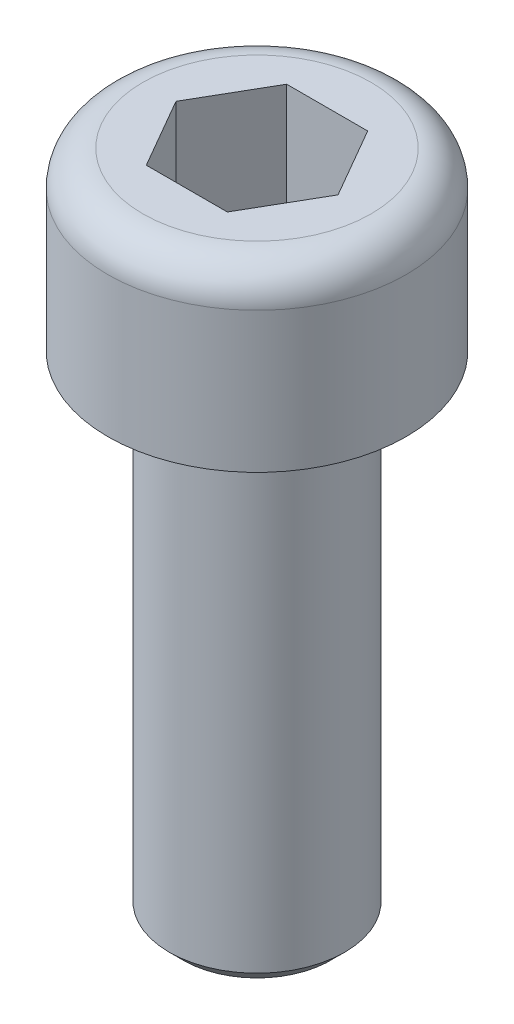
ISO-10303-21;
HEADER;
FILE_DESCRIPTION(('STEP AP214'),'2;1');
FILE_NAME('part.step','',(''),(''),'','','');
FILE_SCHEMA(('AUTOMOTIVE_DESIGN { 1 0 10303 214 1 1 1 1 }'));
ENDSEC;
DATA;
#1=APPLICATION_CONTEXT('core data for automotive mechanical design processes');
#2=APPLICATION_PROTOCOL_DEFINITION('international standard','automotive_design',2000,#1);
#3=PRODUCT_CONTEXT('',#1,'mechanical');
#4=PRODUCT('Part','Part','',(#3));
#5=PRODUCT_RELATED_PRODUCT_CATEGORY('part','',(#4));
#6=PRODUCT_DEFINITION_FORMATION('','',#4);
#7=PRODUCT_DEFINITION_CONTEXT('part definition',#1,'design');
#8=PRODUCT_DEFINITION('design','',#6,#7);
#9=PRODUCT_DEFINITION_SHAPE('','',#8);
#10=(LENGTH_UNIT() NAMED_UNIT(*) SI_UNIT(.MILLI.,.METRE.));
#11=(NAMED_UNIT(*) PLANE_ANGLE_UNIT() SI_UNIT($,.RADIAN.));
#12=(NAMED_UNIT(*) SI_UNIT($,.STERADIAN.) SOLID_ANGLE_UNIT());
#13=UNCERTAINTY_MEASURE_WITH_UNIT(LENGTH_MEASURE(1.E-05),#10,'distance_accuracy_value','');
#14=(GEOMETRIC_REPRESENTATION_CONTEXT(3) GLOBAL_UNCERTAINTY_ASSIGNED_CONTEXT((#13)) GLOBAL_UNIT_ASSIGNED_CONTEXT((#10,
#11,#12)) REPRESENTATION_CONTEXT('',''));
#15=CARTESIAN_POINT('',(0.,0.,0.));
#16=DIRECTION('',(0.,0.,1.));
#17=DIRECTION('',(1.,0.,0.));
#18=AXIS2_PLACEMENT_3D('',#15,#16,#17);
#19=CARTESIAN_POINT('',(0.,5.,0.));
#20=DIRECTION('',(0.,-1.,0.));
#21=DIRECTION('',(1.,0.,0.));
#22=AXIS2_PLACEMENT_3D('',#19,#20,#21);
#23=PLANE('',#22);
#24=DIRECTION('',(-0.5,0.,-0.866025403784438));
#25=VECTOR('',#24,1.);
#26=CARTESIAN_POINT('',(2.3094010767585,5.,0.));
#27=LINE('',#26,#25);
#28=CARTESIAN_POINT('',(2.3094010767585,5.,0.));
#29=VERTEX_POINT('',#28);
#30=CARTESIAN_POINT('',(1.15470053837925,5.,-2.));
#31=VERTEX_POINT('',#30);
#32=EDGE_CURVE('E124',#29,#31,#27,.T.);
#33=ORIENTED_EDGE('',*,*,#32,.F.);
#34=DIRECTION('',(0.5,0.,-0.866025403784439));
#35=VECTOR('',#34,1.);
#36=CARTESIAN_POINT('',(1.15470053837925,5.,2.));
#37=LINE('',#36,#35);
#38=CARTESIAN_POINT('',(1.15470053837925,5.,2.));
#39=VERTEX_POINT('',#38);
#40=EDGE_CURVE('E50',#39,#29,#37,.T.);
#41=ORIENTED_EDGE('',*,*,#40,.F.);
#42=DIRECTION('',(1.,0.,0.));
#43=VECTOR('',#42,1.);
#44=CARTESIAN_POINT('',(-1.15470053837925,5.,2.));
#45=LINE('',#44,#43);
#46=CARTESIAN_POINT('',(-1.15470053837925,5.,2.));
#47=VERTEX_POINT('',#46);
#48=EDGE_CURVE('E133',#47,#39,#45,.T.);
#49=ORIENTED_EDGE('',*,*,#48,.F.);
#50=DIRECTION('',(0.5,0.,0.866025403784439));
#51=VECTOR('',#50,1.);
#52=CARTESIAN_POINT('',(-2.3094010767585,5.,0.));
#53=LINE('',#52,#51);
#54=CARTESIAN_POINT('',(-2.3094010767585,5.,0.));
#55=VERTEX_POINT('',#54);
#56=EDGE_CURVE('E131',#55,#47,#53,.T.);
#57=ORIENTED_EDGE('',*,*,#56,.F.);
#58=DIRECTION('',(-0.5,0.,0.866025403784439));
#59=VECTOR('',#58,1.);
#60=CARTESIAN_POINT('',(-1.15470053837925,5.,-2.));
#61=LINE('',#60,#59);
#62=CARTESIAN_POINT('',(-1.15470053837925,5.,-2.));
#63=VERTEX_POINT('',#62);
#64=EDGE_CURVE('E98',#63,#55,#61,.T.);
#65=ORIENTED_EDGE('',*,*,#64,.F.);
#66=DIRECTION('',(-1.,0.,0.));
#67=VECTOR('',#66,1.);
#68=CARTESIAN_POINT('',(1.15470053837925,5.,-2.));
#69=LINE('',#68,#67);
#70=EDGE_CURVE('E127',#31,#63,#69,.T.);
#71=ORIENTED_EDGE('',*,*,#70,.F.);
#72=EDGE_LOOP('',(#33,#41,#49,#57,#65,#71));
#73=FACE_BOUND('',#72,.T.);
#74=CARTESIAN_POINT('',(0.,5.,0.));
#75=DIRECTION('',(0.,1.,0.));
#76=DIRECTION('',(-1.,0.,0.));
#77=AXIS2_PLACEMENT_3D('',#74,#75,#76);
#78=CIRCLE('',#77,3.25);
#79=CARTESIAN_POINT('',(-3.24999999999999,5.,0.));
#80=VERTEX_POINT('',#79);
#81=EDGE_CURVE('E11',#80,#80,#78,.T.);
#82=ORIENTED_EDGE('',*,*,#81,.T.);
#83=EDGE_LOOP('',(#82));
#84=FACE_BOUND('',#83,.T.);
#85=ADVANCED_FACE('F36',(#73,#84),#23,.F.);
#86=CARTESIAN_POINT('',(0.,4.,0.));
#87=DIRECTION('',(0.,1.,0.));
#88=DIRECTION('',(-1.,0.,0.));
#89=AXIS2_PLACEMENT_3D('',#86,#87,#88);
#90=TOROIDAL_SURFACE('',#89,3.25,1.);
#91=ORIENTED_EDGE('',*,*,#81,.F.);
#92=EDGE_LOOP('',(#91));
#93=FACE_BOUND('',#92,.T.);
#94=CARTESIAN_POINT('',(0.,4.,0.));
#95=DIRECTION('',(0.,1.,0.));
#96=DIRECTION('',(-1.,0.,0.));
#97=AXIS2_PLACEMENT_3D('',#94,#95,#96);
#98=CIRCLE('',#97,4.24999999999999);
#99=CARTESIAN_POINT('',(-4.24999999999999,4.,0.));
#100=VERTEX_POINT('',#99);
#101=EDGE_CURVE('E43',#100,#100,#98,.T.);
#102=ORIENTED_EDGE('',*,*,#101,.T.);
#103=EDGE_LOOP('',(#102));
#104=FACE_BOUND('',#103,.T.);
#105=ADVANCED_FACE('F159',(#93,#104),#90,.T.);
#106=CARTESIAN_POINT('',(0.,5.,0.));
#107=DIRECTION('',(0.,1.,0.));
#108=DIRECTION('',(-1.,0.,0.));
#109=AXIS2_PLACEMENT_3D('',#106,#107,#108);
#110=CYLINDRICAL_SURFACE('',#109,4.24999999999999);
#111=ORIENTED_EDGE('',*,*,#101,.F.);
#112=EDGE_LOOP('',(#111));
#113=FACE_BOUND('',#112,.T.);
#114=CARTESIAN_POINT('',(0.,0.,0.));
#115=DIRECTION('',(0.,1.,0.));
#116=DIRECTION('',(-1.,0.,0.));
#117=AXIS2_PLACEMENT_3D('',#114,#115,#116);
#118=CIRCLE('',#117,4.25);
#119=CARTESIAN_POINT('',(-4.24999999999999,0.,0.));
#120=VERTEX_POINT('',#119);
#121=EDGE_CURVE('E154',#120,#120,#118,.T.);
#122=ORIENTED_EDGE('',*,*,#121,.T.);
#123=EDGE_LOOP('',(#122));
#124=FACE_BOUND('',#123,.T.);
#125=ADVANCED_FACE('F161',(#113,#124),#110,.T.);
#126=CARTESIAN_POINT('',(4.25,0.,0.));
#127=DIRECTION('',(0.,1.,0.));
#128=DIRECTION('',(-1.,0.,0.));
#129=AXIS2_PLACEMENT_3D('',#126,#127,#128);
#130=PLANE('',#129);
#131=ORIENTED_EDGE('',*,*,#121,.F.);
#132=EDGE_LOOP('',(#131));
#133=FACE_BOUND('',#132,.T.);
#134=CARTESIAN_POINT('',(0.,0.,0.));
#135=DIRECTION('',(0.,1.,0.));
#136=DIRECTION('',(-1.,0.,0.));
#137=AXIS2_PLACEMENT_3D('',#134,#135,#136);
#138=CIRCLE('',#137,2.75);
#139=CARTESIAN_POINT('',(-2.74999999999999,0.,0.));
#140=VERTEX_POINT('',#139);
#141=EDGE_CURVE('E151',#140,#140,#138,.T.);
#142=ORIENTED_EDGE('',*,*,#141,.T.);
#143=EDGE_LOOP('',(#142));
#144=FACE_BOUND('',#143,.T.);
#145=ADVANCED_FACE('F164',(#133,#144),#130,.F.);
#146=CARTESIAN_POINT('',(0.,-0.249999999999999,0.));
#147=DIRECTION('',(0.,1.,0.));
#148=DIRECTION('',(-1.,0.,0.));
#149=AXIS2_PLACEMENT_3D('',#146,#147,#148);
#150=TOROIDAL_SURFACE('',#149,2.75,0.25);
#151=ORIENTED_EDGE('',*,*,#141,.F.);
#152=EDGE_LOOP('',(#151));
#153=FACE_BOUND('',#152,.T.);
#154=CARTESIAN_POINT('',(0.,-0.25,0.));
#155=DIRECTION('',(0.,1.,0.));
#156=DIRECTION('',(-1.,0.,0.));
#157=AXIS2_PLACEMENT_3D('',#154,#155,#156);
#158=CIRCLE('',#157,2.5);
#159=CARTESIAN_POINT('',(-2.49999999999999,-0.25,0.));
#160=VERTEX_POINT('',#159);
#161=EDGE_CURVE('E148',#160,#160,#158,.T.);
#162=ORIENTED_EDGE('',*,*,#161,.T.);
#163=EDGE_LOOP('',(#162));
#164=FACE_BOUND('',#163,.T.);
#165=ADVANCED_FACE('F170',(#153,#164),#150,.F.);
#166=CARTESIAN_POINT('',(0.,5.,0.));
#167=DIRECTION('',(0.,1.,0.));
#168=DIRECTION('',(-1.,0.,0.));
#169=AXIS2_PLACEMENT_3D('',#166,#167,#168);
#170=CYLINDRICAL_SURFACE('',#169,2.5);
#171=ORIENTED_EDGE('',*,*,#161,.F.);
#172=EDGE_LOOP('',(#171));
#173=FACE_BOUND('',#172,.T.);
#174=CARTESIAN_POINT('',(0.,-13.6,0.));
#175=DIRECTION('',(0.,1.,0.));
#176=DIRECTION('',(-1.,0.,0.));
#177=AXIS2_PLACEMENT_3D('',#174,#175,#176);
#178=CIRCLE('',#177,2.5);
#179=CARTESIAN_POINT('',(-2.5,-13.6,0.));
#180=VERTEX_POINT('',#179);
#181=EDGE_CURVE('E145',#180,#180,#178,.T.);
#182=ORIENTED_EDGE('',*,*,#181,.T.);
#183=EDGE_LOOP('',(#182));
#184=FACE_BOUND('',#183,.T.);
#185=ADVANCED_FACE('F176',(#173,#184),#170,.T.);
#186=CARTESIAN_POINT('',(0.,-14.,0.));
#187=DIRECTION('',(0.,1.,0.));
#188=DIRECTION('',(-1.,0.,0.));
#189=AXIS2_PLACEMENT_3D('',#186,#187,#188);
#190=CONICAL_SURFACE('',#189,2.1,0.785398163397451);
#191=ORIENTED_EDGE('',*,*,#181,.F.);
#192=EDGE_LOOP('',(#191));
#193=FACE_BOUND('',#192,.T.);
#194=CARTESIAN_POINT('',(0.,-14.,0.));
#195=DIRECTION('',(0.,1.,0.));
#196=DIRECTION('',(-1.,0.,0.));
#197=AXIS2_PLACEMENT_3D('',#194,#195,#196);
#198=CIRCLE('',#197,2.1);
#199=CARTESIAN_POINT('',(-2.1,-14.,0.));
#200=VERTEX_POINT('',#199);
#201=EDGE_CURVE('E137',#200,#200,#198,.T.);
#202=ORIENTED_EDGE('',*,*,#201,.T.);
#203=EDGE_LOOP('',(#202));
#204=FACE_BOUND('',#203,.T.);
#205=ADVANCED_FACE('F182',(#193,#204),#190,.T.);
#206=CARTESIAN_POINT('',(2.1,-14.,0.));
#207=DIRECTION('',(0.,1.,0.));
#208=DIRECTION('',(-1.,0.,0.));
#209=AXIS2_PLACEMENT_3D('',#206,#207,#208);
#210=PLANE('',#209);
#211=ORIENTED_EDGE('',*,*,#201,.F.);
#212=EDGE_LOOP('',(#211));
#213=FACE_BOUND('',#212,.T.);
#214=ADVANCED_FACE('F188',(#213),#210,.F.);
#215=CARTESIAN_POINT('',(1.15470053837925,1.875,2.));
#216=DIRECTION('',(0.866025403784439,0.,0.5));
#217=DIRECTION('',(0.5,0.,-0.866025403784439));
#218=AXIS2_PLACEMENT_3D('',#215,#216,#217);
#219=PLANE('',#218);
#220=ORIENTED_EDGE('',*,*,#40,.T.);
#221=DIRECTION('',(0.,1.,0.));
#222=VECTOR('',#221,1.);
#223=CARTESIAN_POINT('',(2.3094010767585,1.875,0.));
#224=LINE('',#223,#222);
#225=CARTESIAN_POINT('',(2.3094010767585,1.875,0.));
#226=VERTEX_POINT('',#225);
#227=EDGE_CURVE('E80',#226,#29,#224,.T.);
#228=ORIENTED_EDGE('',*,*,#227,.F.);
#229=DIRECTION('',(0.5,0.,-0.866025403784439));
#230=VECTOR('',#229,1.);
#231=CARTESIAN_POINT('',(1.15470053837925,1.875,2.));
#232=LINE('',#231,#230);
#233=CARTESIAN_POINT('',(1.15470053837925,1.875,2.));
#234=VERTEX_POINT('',#233);
#235=EDGE_CURVE('E135',#234,#226,#232,.T.);
#236=ORIENTED_EDGE('',*,*,#235,.F.);
#237=DIRECTION('',(0.,1.,0.));
#238=VECTOR('',#237,1.);
#239=CARTESIAN_POINT('',(1.15470053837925,1.875,2.));
#240=LINE('',#239,#238);
#241=EDGE_CURVE('E58',#234,#39,#240,.T.);
#242=ORIENTED_EDGE('',*,*,#241,.T.);
#243=EDGE_LOOP('',(#220,#228,#236,#242));
#244=FACE_BOUND('',#243,.T.);
#245=ADVANCED_FACE('F193',(#244),#219,.F.);
#246=CARTESIAN_POINT('',(-1.15470053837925,1.875,2.));
#247=DIRECTION('',(0.,0.,1.));
#248=DIRECTION('',(1.,0.,0.));
#249=AXIS2_PLACEMENT_3D('',#246,#247,#248);
#250=PLANE('',#249);
#251=ORIENTED_EDGE('',*,*,#48,.T.);
#252=ORIENTED_EDGE('',*,*,#241,.F.);
#253=DIRECTION('',(1.,0.,0.));
#254=VECTOR('',#253,1.);
#255=CARTESIAN_POINT('',(-1.15470053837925,1.875,2.));
#256=LINE('',#255,#254);
#257=CARTESIAN_POINT('',(-1.15470053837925,1.875,2.));
#258=VERTEX_POINT('',#257);
#259=EDGE_CURVE('E110',#258,#234,#256,.T.);
#260=ORIENTED_EDGE('',*,*,#259,.F.);
#261=DIRECTION('',(0.,1.,0.));
#262=VECTOR('',#261,1.);
#263=CARTESIAN_POINT('',(-1.15470053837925,1.875,2.));
#264=LINE('',#263,#262);
#265=EDGE_CURVE('E102',#258,#47,#264,.T.);
#266=ORIENTED_EDGE('',*,*,#265,.T.);
#267=EDGE_LOOP('',(#251,#252,#260,#266));
#268=FACE_BOUND('',#267,.T.);
#269=ADVANCED_FACE('F198',(#268),#250,.F.);
#270=CARTESIAN_POINT('',(-2.3094010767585,1.875,0.));
#271=DIRECTION('',(-0.866025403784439,0.,0.5));
#272=DIRECTION('',(0.5,0.,0.866025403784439));
#273=AXIS2_PLACEMENT_3D('',#270,#271,#272);
#274=PLANE('',#273);
#275=ORIENTED_EDGE('',*,*,#56,.T.);
#276=ORIENTED_EDGE('',*,*,#265,.F.);
#277=DIRECTION('',(0.5,0.,0.866025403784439));
#278=VECTOR('',#277,1.);
#279=CARTESIAN_POINT('',(-2.3094010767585,1.875,0.));
#280=LINE('',#279,#278);
#281=CARTESIAN_POINT('',(-2.3094010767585,1.875,0.));
#282=VERTEX_POINT('',#281);
#283=EDGE_CURVE('E106',#282,#258,#280,.T.);
#284=ORIENTED_EDGE('',*,*,#283,.F.);
#285=DIRECTION('',(0.,1.,0.));
#286=VECTOR('',#285,1.);
#287=CARTESIAN_POINT('',(-2.3094010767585,1.875,0.));
#288=LINE('',#287,#286);
#289=EDGE_CURVE('E91',#282,#55,#288,.T.);
#290=ORIENTED_EDGE('',*,*,#289,.T.);
#291=EDGE_LOOP('',(#275,#276,#284,#290));
#292=FACE_BOUND('',#291,.T.);
#293=ADVANCED_FACE('F107',(#292),#274,.F.);
#294=CARTESIAN_POINT('',(-1.15470053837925,1.875,-2.));
#295=DIRECTION('',(-0.866025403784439,0.,-0.5));
#296=DIRECTION('',(-0.5,0.,0.866025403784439));
#297=AXIS2_PLACEMENT_3D('',#294,#295,#296);
#298=PLANE('',#297);
#299=ORIENTED_EDGE('',*,*,#64,.T.);
#300=ORIENTED_EDGE('',*,*,#289,.F.);
#301=DIRECTION('',(-0.5,0.,0.866025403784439));
#302=VECTOR('',#301,1.);
#303=CARTESIAN_POINT('',(-1.15470053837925,1.875,-2.));
#304=LINE('',#303,#302);
#305=CARTESIAN_POINT('',(-1.15470053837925,1.875,-2.));
#306=VERTEX_POINT('',#305);
#307=EDGE_CURVE('E95',#306,#282,#304,.T.);
#308=ORIENTED_EDGE('',*,*,#307,.F.);
#309=DIRECTION('',(0.,1.,0.));
#310=VECTOR('',#309,1.);
#311=CARTESIAN_POINT('',(-1.15470053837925,1.875,-2.));
#312=LINE('',#311,#310);
#313=EDGE_CURVE('E103',#306,#63,#312,.T.);
#314=ORIENTED_EDGE('',*,*,#313,.T.);
#315=EDGE_LOOP('',(#299,#300,#308,#314));
#316=FACE_BOUND('',#315,.T.);
#317=ADVANCED_FACE('F93',(#316),#298,.F.);
#318=CARTESIAN_POINT('',(1.15470053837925,1.875,-2.));
#319=DIRECTION('',(0.,0.,-1.));
#320=DIRECTION('',(-1.,0.,0.));
#321=AXIS2_PLACEMENT_3D('',#318,#319,#320);
#322=PLANE('',#321);
#323=ORIENTED_EDGE('',*,*,#70,.T.);
#324=ORIENTED_EDGE('',*,*,#313,.F.);
#325=DIRECTION('',(-1.,0.,0.));
#326=VECTOR('',#325,1.);
#327=CARTESIAN_POINT('',(1.15470053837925,1.875,-2.));
#328=LINE('',#327,#326);
#329=CARTESIAN_POINT('',(1.15470053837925,1.875,-2.));
#330=VERTEX_POINT('',#329);
#331=EDGE_CURVE('E116',#330,#306,#328,.T.);
#332=ORIENTED_EDGE('',*,*,#331,.F.);
#333=DIRECTION('',(0.,1.,0.));
#334=VECTOR('',#333,1.);
#335=CARTESIAN_POINT('',(1.15470053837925,1.875,-2.));
#336=LINE('',#335,#334);
#337=EDGE_CURVE('E140',#330,#31,#336,.T.);
#338=ORIENTED_EDGE('',*,*,#337,.T.);
#339=EDGE_LOOP('',(#323,#324,#332,#338));
#340=FACE_BOUND('',#339,.T.);
#341=ADVANCED_FACE('F224',(#340),#322,.F.);
#342=CARTESIAN_POINT('',(2.3094010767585,1.875,0.));
#343=DIRECTION('',(0.866025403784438,0.,-0.5));
#344=DIRECTION('',(-0.5,0.,-0.866025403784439));
#345=AXIS2_PLACEMENT_3D('',#342,#343,#344);
#346=PLANE('',#345);
#347=ORIENTED_EDGE('',*,*,#32,.T.);
#348=ORIENTED_EDGE('',*,*,#337,.F.);
#349=DIRECTION('',(-0.5,0.,-0.866025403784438));
#350=VECTOR('',#349,1.);
#351=CARTESIAN_POINT('',(2.3094010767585,1.875,0.));
#352=LINE('',#351,#350);
#353=EDGE_CURVE('E118',#226,#330,#352,.T.);
#354=ORIENTED_EDGE('',*,*,#353,.F.);
#355=ORIENTED_EDGE('',*,*,#227,.T.);
#356=EDGE_LOOP('',(#347,#348,#354,#355));
#357=FACE_BOUND('',#356,.T.);
#358=ADVANCED_FACE('F212',(#357),#346,.F.);
#359=CARTESIAN_POINT('',(3.46410161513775,1.875,-2.));
#360=DIRECTION('',(0.,1.,0.));
#361=DIRECTION('',(0.,0.,1.));
#362=AXIS2_PLACEMENT_3D('',#359,#360,#361);
#363=PLANE('',#362);
#364=ORIENTED_EDGE('',*,*,#235,.T.);
#365=ORIENTED_EDGE('',*,*,#353,.T.);
#366=ORIENTED_EDGE('',*,*,#331,.T.);
#367=ORIENTED_EDGE('',*,*,#307,.T.);
#368=ORIENTED_EDGE('',*,*,#283,.T.);
#369=ORIENTED_EDGE('',*,*,#259,.T.);
#370=EDGE_LOOP('',(#364,#365,#366,#367,#368,#369));
#371=FACE_BOUND('',#370,.T.);
#372=ADVANCED_FACE('F113',(#371),#363,.T.);
#373=CLOSED_SHELL('',(#85,#105,#125,#145,#165,#185,#205,#214,#245,#269,#293,#317,#341,#358,#372));
#374=MANIFOLD_SOLID_BREP('B2',#373);
#375=ADVANCED_BREP_SHAPE_REPRESENTATION('',(#18,#374),#14);
#376=SHAPE_DEFINITION_REPRESENTATION(#9,#375);
ENDSEC;
END-ISO-10303-21;
